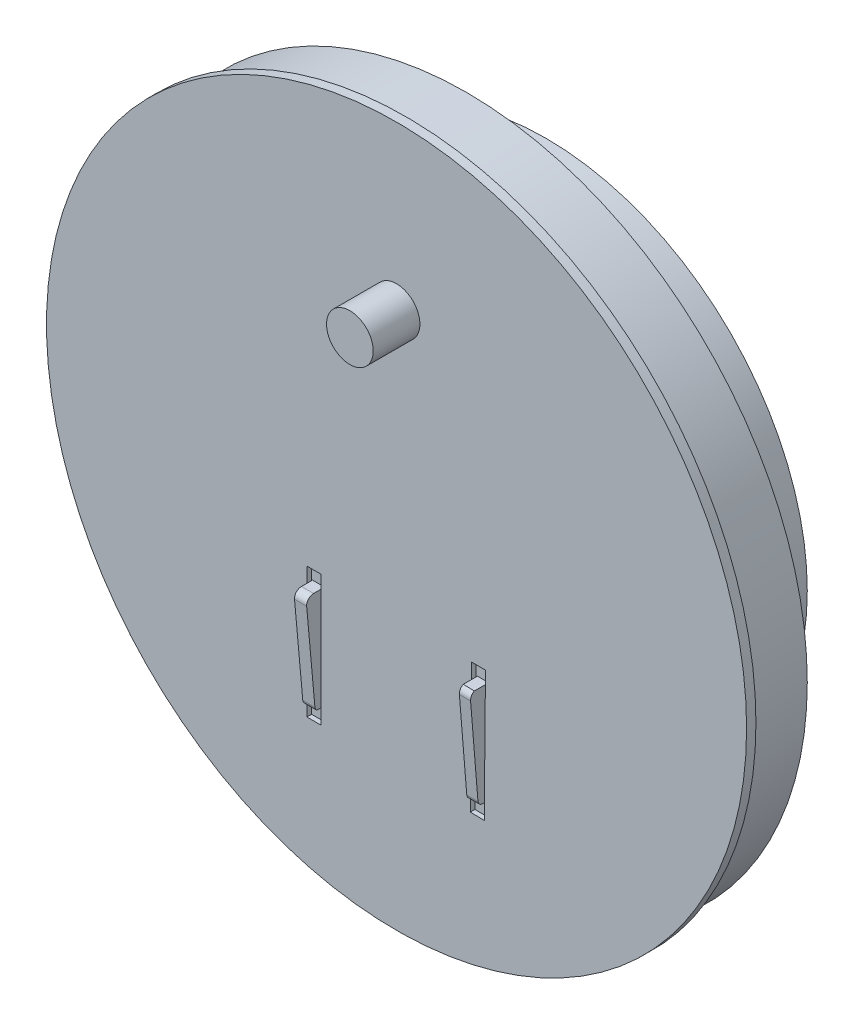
ISO-10303-21;
HEADER;
FILE_DESCRIPTION(('STEP AP214'),'2;1');
FILE_NAME('part.step','',(''),(''),'','','');
FILE_SCHEMA(('AUTOMOTIVE_DESIGN { 1 0 10303 214 1 1 1 1 }'));
ENDSEC;
DATA;
#1=APPLICATION_CONTEXT('core data for automotive mechanical design processes');
#2=APPLICATION_PROTOCOL_DEFINITION('international standard','automotive_design',2000,#1);
#3=PRODUCT_CONTEXT('',#1,'mechanical');
#4=PRODUCT('Part','Part','',(#3));
#5=PRODUCT_RELATED_PRODUCT_CATEGORY('part','',(#4));
#6=PRODUCT_DEFINITION_FORMATION('','',#4);
#7=PRODUCT_DEFINITION_CONTEXT('part definition',#1,'design');
#8=PRODUCT_DEFINITION('design','',#6,#7);
#9=PRODUCT_DEFINITION_SHAPE('','',#8);
#10=(LENGTH_UNIT() NAMED_UNIT(*) SI_UNIT(.MILLI.,.METRE.));
#11=(NAMED_UNIT(*) PLANE_ANGLE_UNIT() SI_UNIT($,.RADIAN.));
#12=(NAMED_UNIT(*) SI_UNIT($,.STERADIAN.) SOLID_ANGLE_UNIT());
#13=UNCERTAINTY_MEASURE_WITH_UNIT(LENGTH_MEASURE(1.E-05),#10,'distance_accuracy_value','');
#14=(GEOMETRIC_REPRESENTATION_CONTEXT(3) GLOBAL_UNCERTAINTY_ASSIGNED_CONTEXT((#13)) GLOBAL_UNIT_ASSIGNED_CONTEXT((#10,
#11,#12)) REPRESENTATION_CONTEXT('',''));
#15=CARTESIAN_POINT('',(0.,0.,0.));
#16=DIRECTION('',(0.,0.,1.));
#17=DIRECTION('',(1.,0.,0.));
#18=AXIS2_PLACEMENT_3D('',#15,#16,#17);
#19=CARTESIAN_POINT('',(16.1168721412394,-42.1527685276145,5.));
#20=DIRECTION('',(0.00936412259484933,0.999956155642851,0.));
#21=DIRECTION('',(-0.999956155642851,0.00936412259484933,0.));
#22=AXIS2_PLACEMENT_3D('',#19,#20,#21);
#23=PLANE('',#22);
#24=DIRECTION('',(0.,0.,-1.));
#25=VECTOR('',#24,1.);
#26=CARTESIAN_POINT('',(18.5167669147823,-42.1752424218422,5.));
#27=LINE('',#26,#25);
#28=CARTESIAN_POINT('',(18.5167669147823,-42.1752424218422,2.0861317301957));
#29=VERTEX_POINT('',#28);
#30=CARTESIAN_POINT('',(18.5167669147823,-42.1752424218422,1.));
#31=VERTEX_POINT('',#30);
#32=EDGE_CURVE('E314',#29,#31,#27,.T.);
#33=ORIENTED_EDGE('',*,*,#32,.F.);
#34=CARTESIAN_POINT('',(-88.269122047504,-41.1752424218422,2.0861317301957));
#35=DIRECTION('',(0.00936412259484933,0.999956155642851,0.));
#36=DIRECTION('',(-0.999956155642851,0.00936412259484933,0.));
#37=AXIS2_PLACEMENT_3D('',#34,#35,#36);
#38=ELLIPSE('',#37,106.790571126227,1.);
#39=CARTESIAN_POINT('',(16.1168721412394,-42.1527685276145,2.29694613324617));
#40=VERTEX_POINT('',#39);
#41=EDGE_CURVE('E276',#29,#40,#38,.F.);
#42=ORIENTED_EDGE('',*,*,#41,.T.);
#43=DIRECTION('',(0.,0.,-1.));
#44=VECTOR('',#43,1.);
#45=CARTESIAN_POINT('',(16.1168721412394,-42.1527685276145,5.));
#46=LINE('',#45,#44);
#47=CARTESIAN_POINT('',(16.1168721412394,-42.1527685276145,1.));
#48=VERTEX_POINT('',#47);
#49=EDGE_CURVE('E317',#40,#48,#46,.T.);
#50=ORIENTED_EDGE('',*,*,#49,.T.);
#51=DIRECTION('',(0.99995615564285,-0.00936412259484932,0.));
#52=VECTOR('',#51,1.);
#53=CARTESIAN_POINT('',(16.1168721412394,-42.1527685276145,1.));
#54=LINE('',#53,#52);
#55=EDGE_CURVE('E296',#48,#31,#54,.T.);
#56=ORIENTED_EDGE('',*,*,#55,.T.);
#57=EDGE_LOOP('',(#33,#42,#50,#56));
#58=FACE_BOUND('',#57,.T.);
#59=ADVANCED_FACE('F41',(#58),#23,.F.);
#60=CARTESIAN_POINT('',(18.722777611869,-20.1762069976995,5.));
#61=DIRECTION('',(-0.00936412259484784,-0.999956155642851,0.));
#62=DIRECTION('',(0.999956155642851,-0.00936412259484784,0.));
#63=AXIS2_PLACEMENT_3D('',#60,#61,#62);
#64=PLANE('',#63);
#65=DIRECTION('',(0.,0.,-1.));
#66=VECTOR('',#65,1.);
#67=CARTESIAN_POINT('',(16.3228828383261,-20.1537331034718,5.));
#68=LINE('',#67,#66);
#69=CARTESIAN_POINT('',(16.3228828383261,-20.1537331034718,4.02011287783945));
#70=VERTEX_POINT('',#69);
#71=CARTESIAN_POINT('',(16.3228828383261,-20.1537331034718,1.));
#72=VERTEX_POINT('',#71);
#73=EDGE_CURVE('E308',#70,#72,#68,.T.);
#74=ORIENTED_EDGE('',*,*,#73,.F.);
#75=CARTESIAN_POINT('',(160.085190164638,-21.5000000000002,3.35862558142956));
#76=DIRECTION('',(-0.00936412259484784,-0.999956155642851,0.));
#77=DIRECTION('',(-0.999956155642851,0.00936412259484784,0.));
#78=AXIS2_PLACEMENT_3D('',#75,#76,#77);
#79=ELLIPSE('',#78,160.185856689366,1.5);
#80=CARTESIAN_POINT('',(18.722777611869,-20.1762069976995,4.06401347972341));
#81=VERTEX_POINT('',#80);
#82=EDGE_CURVE('E574',#70,#81,#79,.F.);
#83=ORIENTED_EDGE('',*,*,#82,.T.);
#84=DIRECTION('',(0.,0.,-1.));
#85=VECTOR('',#84,1.);
#86=CARTESIAN_POINT('',(18.722777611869,-20.1762069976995,5.));
#87=LINE('',#86,#85);
#88=CARTESIAN_POINT('',(18.722777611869,-20.1762069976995,1.));
#89=VERTEX_POINT('',#88);
#90=EDGE_CURVE('E311',#81,#89,#87,.T.);
#91=ORIENTED_EDGE('',*,*,#90,.T.);
#92=DIRECTION('',(-0.99995615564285,0.00936412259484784,0.));
#93=VECTOR('',#92,1.);
#94=CARTESIAN_POINT('',(18.722777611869,-20.1762069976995,1.));
#95=LINE('',#94,#93);
#96=EDGE_CURVE('E304',#89,#72,#95,.T.);
#97=ORIENTED_EDGE('',*,*,#96,.T.);
#98=EDGE_LOOP('',(#74,#83,#91,#97));
#99=FACE_BOUND('',#98,.T.);
#100=ADVANCED_FACE('F604',(#99),#64,.F.);
#101=CARTESIAN_POINT('',(0.,0.,1.));
#102=DIRECTION('',(0.,0.,1.));
#103=DIRECTION('',(1.,0.,0.));
#104=AXIS2_PLACEMENT_3D('',#101,#102,#103);
#105=PLANE('',#104);
#106=DIRECTION('',(0.00936412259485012,0.999956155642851,0.));
#107=VECTOR('',#106,1.);
#108=CARTESIAN_POINT('',(19.2100469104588,-0.179893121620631,1.));
#109=LINE('',#108,#107);
#110=CARTESIAN_POINT('',(18.7886613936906,-45.1779201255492,0.999999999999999));
#111=VERTEX_POINT('',#110);
#112=CARTESIAN_POINT('',(19.0508568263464,-17.1791477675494,0.999999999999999));
#113=VERTEX_POINT('',#112);
#114=EDGE_CURVE('E554',#111,#113,#109,.T.);
#115=ORIENTED_EDGE('',*,*,#114,.T.);
#116=DIRECTION('',(-0.999956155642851,0.00936412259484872,0.));
#117=VECTOR('',#116,1.);
#118=CARTESIAN_POINT('',(-0.159190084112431,-16.9992546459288,1.));
#119=LINE('',#118,#117);
#120=CARTESIAN_POINT('',(16.0509883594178,-17.1510553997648,0.999999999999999));
#121=VERTEX_POINT('',#120);
#122=EDGE_CURVE('E527',#113,#121,#119,.T.);
#123=ORIENTED_EDGE('',*,*,#122,.T.);
#124=DIRECTION('',(-0.00936412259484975,-0.999956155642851,0.));
#125=VECTOR('',#124,1.);
#126=CARTESIAN_POINT('',(16.2101784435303,-0.151800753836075,1.));
#127=LINE('',#126,#125);
#128=CARTESIAN_POINT('',(15.788792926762,-45.1498277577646,0.999999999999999));
#129=VERTEX_POINT('',#128);
#130=EDGE_CURVE('E546',#121,#129,#127,.T.);
#131=ORIENTED_EDGE('',*,*,#130,.T.);
#132=DIRECTION('',(0.999956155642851,-0.00936412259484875,0.));
#133=VECTOR('',#132,1.);
#134=CARTESIAN_POINT('',(-0.421385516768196,-44.9980270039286,1.));
#135=LINE('',#134,#133);
#136=EDGE_CURVE('E550',#129,#111,#135,.T.);
#137=ORIENTED_EDGE('',*,*,#136,.T.);
#138=EDGE_LOOP('',(#115,#123,#131,#137));
#139=FACE_BOUND('',#138,.T.);
#140=ORIENTED_EDGE('',*,*,#55,.F.);
#141=DIRECTION('',(-0.0093641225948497,-0.999956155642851,0.));
#142=VECTOR('',#141,1.);
#143=CARTESIAN_POINT('',(16.3228828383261,-20.1537331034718,1.));
#144=LINE('',#143,#142);
#145=EDGE_CURVE('E292',#72,#48,#144,.T.);
#146=ORIENTED_EDGE('',*,*,#145,.F.);
#147=ORIENTED_EDGE('',*,*,#96,.F.);
#148=DIRECTION('',(0.00936412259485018,0.999956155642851,0.));
#149=VECTOR('',#148,1.);
#150=CARTESIAN_POINT('',(18.5167669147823,-42.1752424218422,1.));
#151=LINE('',#150,#149);
#152=EDGE_CURVE('E300',#31,#89,#151,.T.);
#153=ORIENTED_EDGE('',*,*,#152,.F.);
#154=EDGE_LOOP('',(#140,#146,#147,#153));
#155=FACE_BOUND('',#154,.T.);
#156=ADVANCED_FACE('F601',(#139,#155),#105,.T.);
#157=CARTESIAN_POINT('',(0.,0.,1.));
#158=DIRECTION('',(0.,0.,-1.));
#159=DIRECTION('',(-1.,0.,0.));
#160=AXIS2_PLACEMENT_3D('',#157,#158,#159);
#161=PLANE('',#160);
#162=DIRECTION('',(-1.,0.,0.));
#163=VECTOR('',#162,1.);
#164=CARTESIAN_POINT('',(0.,-17.0000000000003,1.));
#165=LINE('',#164,#163);
#166=CARTESIAN_POINT('',(-16.2108891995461,-17.0000000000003,0.999999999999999));
#167=VERTEX_POINT('',#166);
#168=CARTESIAN_POINT('',(-19.2108891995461,-17.0000000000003,0.999999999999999));
#169=VERTEX_POINT('',#168);
#170=EDGE_CURVE('E566',#167,#169,#165,.T.);
#171=ORIENTED_EDGE('',*,*,#170,.T.);
#172=DIRECTION('',(0.,-1.,0.));
#173=VECTOR('',#172,1.);
#174=CARTESIAN_POINT('',(-19.2108891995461,0.,1.));
#175=LINE('',#174,#173);
#176=CARTESIAN_POINT('',(-19.2108891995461,-45.0000000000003,0.999999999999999));
#177=VERTEX_POINT('',#176);
#178=EDGE_CURVE('E570',#169,#177,#175,.T.);
#179=ORIENTED_EDGE('',*,*,#178,.T.);
#180=DIRECTION('',(1.,0.,0.));
#181=VECTOR('',#180,1.);
#182=CARTESIAN_POINT('',(0.,-45.0000000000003,1.));
#183=LINE('',#182,#181);
#184=CARTESIAN_POINT('',(-16.2108891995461,-45.0000000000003,0.999999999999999));
#185=VERTEX_POINT('',#184);
#186=EDGE_CURVE('E558',#177,#185,#183,.T.);
#187=ORIENTED_EDGE('',*,*,#186,.T.);
#188=DIRECTION('',(0.,1.,0.));
#189=VECTOR('',#188,1.);
#190=CARTESIAN_POINT('',(-16.2108891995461,0.,1.));
#191=LINE('',#190,#189);
#192=EDGE_CURVE('E562',#185,#167,#191,.T.);
#193=ORIENTED_EDGE('',*,*,#192,.T.);
#194=EDGE_LOOP('',(#171,#179,#187,#193));
#195=FACE_BOUND('',#194,.T.);
#196=DIRECTION('',(0.,-1.,0.));
#197=VECTOR('',#196,1.);
#198=CARTESIAN_POINT('',(-19.0108891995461,-20.0000000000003,1.));
#199=LINE('',#198,#197);
#200=CARTESIAN_POINT('',(-19.0108891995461,-20.0000000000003,1.));
#201=VERTEX_POINT('',#200);
#202=CARTESIAN_POINT('',(-19.0108891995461,-42.0000000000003,1.));
#203=VERTEX_POINT('',#202);
#204=EDGE_CURVE('E320',#201,#203,#199,.T.);
#205=ORIENTED_EDGE('',*,*,#204,.F.);
#206=DIRECTION('',(-1.,0.,0.));
#207=VECTOR('',#206,1.);
#208=CARTESIAN_POINT('',(-16.4108891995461,-20.0000000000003,1.));
#209=LINE('',#208,#207);
#210=CARTESIAN_POINT('',(-16.4108891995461,-20.0000000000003,1.));
#211=VERTEX_POINT('',#210);
#212=EDGE_CURVE('E332',#211,#201,#209,.T.);
#213=ORIENTED_EDGE('',*,*,#212,.F.);
#214=DIRECTION('',(0.,1.,0.));
#215=VECTOR('',#214,1.);
#216=CARTESIAN_POINT('',(-16.4108891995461,-42.0000000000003,1.));
#217=LINE('',#216,#215);
#218=CARTESIAN_POINT('',(-16.4108891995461,-42.0000000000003,1.));
#219=VERTEX_POINT('',#218);
#220=EDGE_CURVE('E328',#219,#211,#217,.T.);
#221=ORIENTED_EDGE('',*,*,#220,.F.);
#222=DIRECTION('',(1.,0.,0.));
#223=VECTOR('',#222,1.);
#224=CARTESIAN_POINT('',(-19.0108891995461,-42.0000000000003,1.));
#225=LINE('',#224,#223);
#226=EDGE_CURVE('E324',#203,#219,#225,.T.);
#227=ORIENTED_EDGE('',*,*,#226,.F.);
#228=EDGE_LOOP('',(#205,#213,#221,#227));
#229=FACE_BOUND('',#228,.T.);
#230=ADVANCED_FACE('F611',(#195,#229),#161,.F.);
#231=CARTESIAN_POINT('',(0.,0.,2.));
#232=DIRECTION('',(0.,0.,-1.));
#233=DIRECTION('',(-1.,0.,0.));
#234=AXIS2_PLACEMENT_3D('',#231,#232,#233);
#235=CYLINDRICAL_SURFACE('',#234,75.);
#236=CARTESIAN_POINT('',(0.,0.,2.));
#237=DIRECTION('',(0.,0.,1.));
#238=DIRECTION('',(1.,0.,0.));
#239=AXIS2_PLACEMENT_3D('',#236,#237,#238);
#240=CIRCLE('',#239,75.);
#241=CARTESIAN_POINT('',(75.,0.,2.));
#242=VERTEX_POINT('',#241);
#243=EDGE_CURVE('E536',#242,#242,#240,.T.);
#244=ORIENTED_EDGE('',*,*,#243,.F.);
#245=EDGE_LOOP('',(#244));
#246=FACE_BOUND('',#245,.T.);
#247=CARTESIAN_POINT('',(0.,0.,0.));
#248=DIRECTION('',(0.,0.,1.));
#249=DIRECTION('',(1.,0.,0.));
#250=AXIS2_PLACEMENT_3D('',#247,#248,#249);
#251=CIRCLE('',#250,75.);
#252=CARTESIAN_POINT('',(75.,0.,0.));
#253=VERTEX_POINT('',#252);
#254=EDGE_CURVE('E532',#253,#253,#251,.T.);
#255=ORIENTED_EDGE('',*,*,#254,.T.);
#256=EDGE_LOOP('',(#255));
#257=FACE_BOUND('',#256,.T.);
#258=ADVANCED_FACE('F43',(#246,#257),#235,.T.);
#259=CARTESIAN_POINT('',(0.,0.,2.));
#260=DIRECTION('',(0.,0.,1.));
#261=DIRECTION('',(1.,0.,0.));
#262=AXIS2_PLACEMENT_3D('',#259,#260,#261);
#263=PLANE('',#262);
#264=DIRECTION('',(0.,-1.,0.));
#265=VECTOR('',#264,1.);
#266=CARTESIAN_POINT('',(-19.2108891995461,-45.0000000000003,2.));
#267=LINE('',#266,#265);
#268=CARTESIAN_POINT('',(-19.2108891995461,-17.0000000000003,2.));
#269=VERTEX_POINT('',#268);
#270=CARTESIAN_POINT('',(-19.2108891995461,-45.0000000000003,2.));
#271=VERTEX_POINT('',#270);
#272=EDGE_CURVE('E439',#269,#271,#267,.T.);
#273=ORIENTED_EDGE('',*,*,#272,.F.);
#274=DIRECTION('',(-1.,0.,0.));
#275=VECTOR('',#274,1.);
#276=CARTESIAN_POINT('',(-19.2108891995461,-17.0000000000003,2.));
#277=LINE('',#276,#275);
#278=CARTESIAN_POINT('',(-16.2108891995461,-17.0000000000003,2.));
#279=VERTEX_POINT('',#278);
#280=EDGE_CURVE('E451',#279,#269,#277,.T.);
#281=ORIENTED_EDGE('',*,*,#280,.F.);
#282=DIRECTION('',(0.,1.,0.));
#283=VECTOR('',#282,1.);
#284=CARTESIAN_POINT('',(-16.2108891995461,-45.0000000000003,2.));
#285=LINE('',#284,#283);
#286=CARTESIAN_POINT('',(-16.2108891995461,-45.0000000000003,2.));
#287=VERTEX_POINT('',#286);
#288=EDGE_CURVE('E447',#287,#279,#285,.T.);
#289=ORIENTED_EDGE('',*,*,#288,.F.);
#290=DIRECTION('',(1.,0.,0.));
#291=VECTOR('',#290,1.);
#292=CARTESIAN_POINT('',(-19.2108891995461,-45.0000000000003,2.));
#293=LINE('',#292,#291);
#294=EDGE_CURVE('E442',#271,#287,#293,.T.);
#295=ORIENTED_EDGE('',*,*,#294,.F.);
#296=EDGE_LOOP('',(#273,#281,#289,#295));
#297=FACE_BOUND('',#296,.T.);
#298=DIRECTION('',(0.00936412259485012,0.99995615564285,0.));
#299=VECTOR('',#298,1.);
#300=CARTESIAN_POINT('',(18.7886613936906,-45.1779201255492,2.));
#301=LINE('',#300,#299);
#302=CARTESIAN_POINT('',(18.7886613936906,-45.1779201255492,2.));
#303=VERTEX_POINT('',#302);
#304=CARTESIAN_POINT('',(19.0508568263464,-17.1791477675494,2.));
#305=VERTEX_POINT('',#304);
#306=EDGE_CURVE('E424',#303,#305,#301,.T.);
#307=ORIENTED_EDGE('',*,*,#306,.F.);
#308=DIRECTION('',(0.99995615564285,-0.00936412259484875,0.));
#309=VECTOR('',#308,1.);
#310=CARTESIAN_POINT('',(18.7886613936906,-45.1779201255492,2.));
#311=LINE('',#310,#309);
#312=CARTESIAN_POINT('',(15.788792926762,-45.1498277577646,2.));
#313=VERTEX_POINT('',#312);
#314=EDGE_CURVE('E479',#313,#303,#311,.T.);
#315=ORIENTED_EDGE('',*,*,#314,.F.);
#316=DIRECTION('',(-0.00936412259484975,-0.99995615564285,0.));
#317=VECTOR('',#316,1.);
#318=CARTESIAN_POINT('',(15.788792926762,-45.1498277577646,2.));
#319=LINE('',#318,#317);
#320=CARTESIAN_POINT('',(16.0509883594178,-17.1510553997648,2.));
#321=VERTEX_POINT('',#320);
#322=EDGE_CURVE('E475',#321,#313,#319,.T.);
#323=ORIENTED_EDGE('',*,*,#322,.F.);
#324=DIRECTION('',(-0.999956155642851,0.00936412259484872,0.));
#325=VECTOR('',#324,1.);
#326=CARTESIAN_POINT('',(19.0508568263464,-17.1791477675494,2.));
#327=LINE('',#326,#325);
#328=EDGE_CURVE('E471',#305,#321,#327,.T.);
#329=ORIENTED_EDGE('',*,*,#328,.F.);
#330=EDGE_LOOP('',(#307,#315,#323,#329));
#331=FACE_BOUND('',#330,.T.);
#332=CARTESIAN_POINT('',(0.,40.,2.));
#333=DIRECTION('',(0.,0.,1.));
#334=DIRECTION('',(1.,0.,0.));
#335=AXIS2_PLACEMENT_3D('',#332,#333,#334);
#336=CIRCLE('',#335,5.);
#337=CARTESIAN_POINT('',(5.00000000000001,40.,2.));
#338=VERTEX_POINT('',#337);
#339=EDGE_CURVE('E459',#338,#338,#336,.T.);
#340=ORIENTED_EDGE('',*,*,#339,.F.);
#341=EDGE_LOOP('',(#340));
#342=FACE_BOUND('',#341,.T.);
#343=ORIENTED_EDGE('',*,*,#243,.T.);
#344=EDGE_LOOP('',(#343));
#345=FACE_BOUND('',#344,.T.);
#346=ADVANCED_FACE('F752',(#297,#331,#342,#345),#263,.T.);
#347=CARTESIAN_POINT('',(0.,0.,0.));
#348=DIRECTION('',(0.,0.,1.));
#349=DIRECTION('',(1.,0.,0.));
#350=AXIS2_PLACEMENT_3D('',#347,#348,#349);
#351=PLANE('',#350);
#352=CARTESIAN_POINT('',(0.,0.,0.));
#353=DIRECTION('',(0.,0.,-1.));
#354=DIRECTION('',(-1.,0.,0.));
#355=AXIS2_PLACEMENT_3D('',#352,#353,#354);
#356=CIRCLE('',#355,73.);
#357=CARTESIAN_POINT('',(73.,0.,0.));
#358=VERTEX_POINT('',#357);
#359=EDGE_CURVE('E528',#358,#358,#356,.T.);
#360=ORIENTED_EDGE('',*,*,#359,.F.);
#361=EDGE_LOOP('',(#360));
#362=FACE_BOUND('',#361,.T.);
#363=ORIENTED_EDGE('',*,*,#254,.F.);
#364=EDGE_LOOP('',(#363));
#365=FACE_BOUND('',#364,.T.);
#366=ADVANCED_FACE('F750',(#362,#365),#351,.F.);
#367=CARTESIAN_POINT('',(0.,0.,-13.));
#368=DIRECTION('',(0.,0.,1.));
#369=DIRECTION('',(1.,0.,0.));
#370=AXIS2_PLACEMENT_3D('',#367,#368,#369);
#371=CYLINDRICAL_SURFACE('',#370,73.);
#372=CARTESIAN_POINT('',(0.,0.,-13.));
#373=DIRECTION('',(0.,0.,-1.));
#374=DIRECTION('',(-1.,0.,0.));
#375=AXIS2_PLACEMENT_3D('',#372,#373,#374);
#376=CIRCLE('',#375,73.);
#377=CARTESIAN_POINT('',(73.,0.,-13.));
#378=VERTEX_POINT('',#377);
#379=EDGE_CURVE('E522',#378,#378,#376,.T.);
#380=CARTESIAN_POINT('',(73.,0.,-13.));
#381=CARTESIAN_POINT('',(73.,0.,-12.8645833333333));
#382=CARTESIAN_POINT('',(73.,0.,-12.7291666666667));
#383=CARTESIAN_POINT('',(73.,0.,-12.4583333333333));
#384=CARTESIAN_POINT('',(73.,0.,-12.3229166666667));
#385=CARTESIAN_POINT('',(73.,0.,-12.0520833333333));
#386=CARTESIAN_POINT('',(73.,0.,-11.9166666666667));
#387=CARTESIAN_POINT('',(73.,0.,-11.6458333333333));
#388=CARTESIAN_POINT('',(73.,0.,-11.5104166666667));
#389=CARTESIAN_POINT('',(73.,0.,-11.2395833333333));
#390=CARTESIAN_POINT('',(73.,0.,-11.1041666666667));
#391=CARTESIAN_POINT('',(73.,0.,-10.8333333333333));
#392=CARTESIAN_POINT('',(73.,0.,-10.6979166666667));
#393=CARTESIAN_POINT('',(73.,0.,-10.4270833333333));
#394=CARTESIAN_POINT('',(73.,0.,-10.2916666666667));
#395=CARTESIAN_POINT('',(73.,0.,-10.0208333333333));
#396=CARTESIAN_POINT('',(73.,0.,-9.88541666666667));
#397=CARTESIAN_POINT('',(73.,0.,-9.61458333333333));
#398=CARTESIAN_POINT('',(73.,0.,-9.47916666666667));
#399=CARTESIAN_POINT('',(73.,0.,-9.20833333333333));
#400=CARTESIAN_POINT('',(73.,0.,-9.07291666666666));
#401=CARTESIAN_POINT('',(73.,0.,-8.80208333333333));
#402=CARTESIAN_POINT('',(73.,0.,-8.66666666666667));
#403=CARTESIAN_POINT('',(73.,0.,-8.39583333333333));
#404=CARTESIAN_POINT('',(73.,0.,-8.26041666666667));
#405=CARTESIAN_POINT('',(73.,0.,-7.98958333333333));
#406=CARTESIAN_POINT('',(73.,0.,-7.85416666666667));
#407=CARTESIAN_POINT('',(73.,0.,-7.58333333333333));
#408=CARTESIAN_POINT('',(73.,0.,-7.44791666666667));
#409=CARTESIAN_POINT('',(73.,0.,-7.17708333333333));
#410=CARTESIAN_POINT('',(73.,0.,-7.04166666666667));
#411=CARTESIAN_POINT('',(73.,0.,-6.77083333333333));
#412=CARTESIAN_POINT('',(73.,0.,-6.63541666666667));
#413=CARTESIAN_POINT('',(73.,0.,-6.36458333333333));
#414=CARTESIAN_POINT('',(73.,0.,-6.22916666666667));
#415=CARTESIAN_POINT('',(73.,0.,-5.95833333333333));
#416=CARTESIAN_POINT('',(73.,0.,-5.82291666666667));
#417=CARTESIAN_POINT('',(73.,0.,-5.55208333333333));
#418=CARTESIAN_POINT('',(73.,0.,-5.41666666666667));
#419=CARTESIAN_POINT('',(73.,0.,-5.14583333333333));
#420=CARTESIAN_POINT('',(73.,0.,-5.01041666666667));
#421=CARTESIAN_POINT('',(73.,0.,-4.73958333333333));
#422=CARTESIAN_POINT('',(73.,0.,-4.60416666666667));
#423=CARTESIAN_POINT('',(73.,0.,-4.33333333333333));
#424=CARTESIAN_POINT('',(73.,0.,-4.19791666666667));
#425=CARTESIAN_POINT('',(73.,0.,-3.92708333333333));
#426=CARTESIAN_POINT('',(73.,0.,-3.79166666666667));
#427=CARTESIAN_POINT('',(73.,0.,-3.52083333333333));
#428=CARTESIAN_POINT('',(73.,0.,-3.38541666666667));
#429=CARTESIAN_POINT('',(73.,0.,-3.11458333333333));
#430=CARTESIAN_POINT('',(73.,0.,-2.97916666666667));
#431=CARTESIAN_POINT('',(73.,0.,-2.70833333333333));
#432=CARTESIAN_POINT('',(73.,0.,-2.57291666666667));
#433=CARTESIAN_POINT('',(73.,0.,-2.30208333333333));
#434=CARTESIAN_POINT('',(73.,0.,-2.16666666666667));
#435=CARTESIAN_POINT('',(73.,0.,-1.89583333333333));
#436=CARTESIAN_POINT('',(73.,0.,-1.76041666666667));
#437=CARTESIAN_POINT('',(73.,0.,-1.48958333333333));
#438=CARTESIAN_POINT('',(73.,0.,-1.35416666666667));
#439=CARTESIAN_POINT('',(73.,0.,-1.08333333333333));
#440=CARTESIAN_POINT('',(73.,0.,-0.947916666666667));
#441=CARTESIAN_POINT('',(73.,0.,-0.677083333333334));
#442=CARTESIAN_POINT('',(73.,0.,-0.541666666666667));
#443=CARTESIAN_POINT('',(73.,0.,-0.270833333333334));
#444=CARTESIAN_POINT('',(73.,0.,-0.135416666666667));
#445=CARTESIAN_POINT('',(73.,0.,0.));
#446=B_SPLINE_CURVE_WITH_KNOTS('',3,(#380,#381,#382,#383,#384,#385,#386,#387,#388,#389,#390,
#391,#392,#393,#394,#395,#396,#397,#398,#399,#400,#401,#402,#403,#404,#405,#406,#407,#408,#409,
#410,#411,#412,#413,#414,#415,#416,#417,#418,#419,#420,#421,#422,#423,#424,#425,#426,#427,#428,
#429,#430,#431,#432,#433,#434,#435,#436,#437,#438,#439,#440,#441,#442,#443,#444,#445),
.UNSPECIFIED.,.F.,.F.,(4,2,2,2,2,2,2,2,2,2,2,2,2,2,2,2,2,2,2,2,2,2,2,2,2,2,2,2,2,2,2,2,4),(0.,
0.40625,0.812500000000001,1.21875,1.625,2.03125,2.4375,2.84375,3.25,3.65625,4.0625,4.46875,
4.875,5.28125,5.6875,6.09375,6.5,6.90625,7.3125,7.71875,8.125,8.53125,8.9375,9.34375,9.75,
10.15625,10.5625,10.96875,11.375,11.78125,12.1875,12.59375,13.),.UNSPECIFIED.);
#447=EDGE_CURVE('BSEAM746',#378,#358,#446,.T.);
#448=ORIENTED_EDGE('',*,*,#379,.F.);
#449=ORIENTED_EDGE('',*,*,#359,.T.);
#450=ORIENTED_EDGE('',*,*,#447,.T.);
#451=ORIENTED_EDGE('',*,*,#447,.F.);
#452=EDGE_LOOP('',(#448,#450,#449,#451));
#453=FACE_BOUND('',#452,.T.);
#454=ADVANCED_FACE('F746',(#453),#371,.T.);
#455=CARTESIAN_POINT('',(0.,0.,-13.));
#456=DIRECTION('',(0.,0.,-1.));
#457=DIRECTION('',(-1.,0.,0.));
#458=AXIS2_PLACEMENT_3D('',#455,#456,#457);
#459=PLANE('',#458);
#460=CARTESIAN_POINT('',(0.,0.,-13.));
#461=DIRECTION('',(0.,0.,-1.));
#462=DIRECTION('',(-1.,0.,0.));
#463=AXIS2_PLACEMENT_3D('',#460,#461,#462);
#464=CIRCLE('',#463,56.);
#465=CARTESIAN_POINT('',(-56.,0.,-13.));
#466=VERTEX_POINT('',#465);
#467=EDGE_CURVE('E523',#466,#466,#464,.T.);
#468=ORIENTED_EDGE('',*,*,#467,.F.);
#469=EDGE_LOOP('',(#468));
#470=FACE_BOUND('',#469,.T.);
#471=ORIENTED_EDGE('',*,*,#379,.T.);
#472=EDGE_LOOP('',(#471));
#473=FACE_BOUND('',#472,.T.);
#474=ADVANCED_FACE('F742',(#470,#473),#459,.T.);
#475=CARTESIAN_POINT('',(0.,0.,-30.));
#476=DIRECTION('',(0.,0.,1.));
#477=DIRECTION('',(1.,0.,0.));
#478=AXIS2_PLACEMENT_3D('',#475,#476,#477);
#479=CYLINDRICAL_SURFACE('',#478,56.);
#480=CARTESIAN_POINT('',(0.,0.,-30.));
#481=DIRECTION('',(0.,0.,-1.));
#482=DIRECTION('',(-1.,0.,0.));
#483=AXIS2_PLACEMENT_3D('',#480,#481,#482);
#484=CIRCLE('',#483,56.);
#485=CARTESIAN_POINT('',(-56.,0.,-30.));
#486=VERTEX_POINT('',#485);
#487=EDGE_CURVE('E515',#486,#486,#484,.T.);
#488=ORIENTED_EDGE('',*,*,#487,.F.);
#489=EDGE_LOOP('',(#488));
#490=FACE_BOUND('',#489,.T.);
#491=ORIENTED_EDGE('',*,*,#467,.T.);
#492=EDGE_LOOP('',(#491));
#493=FACE_BOUND('',#492,.T.);
#494=ADVANCED_FACE('F738',(#490,#493),#479,.T.);
#495=CARTESIAN_POINT('',(0.,0.,-30.));
#496=DIRECTION('',(0.,0.,-1.));
#497=DIRECTION('',(-1.,0.,0.));
#498=AXIS2_PLACEMENT_3D('',#495,#496,#497);
#499=PLANE('',#498);
#500=CARTESIAN_POINT('',(0.,0.,-30.));
#501=DIRECTION('',(0.,0.,-1.));
#502=DIRECTION('',(-1.,0.,0.));
#503=AXIS2_PLACEMENT_3D('',#500,#501,#502);
#504=CIRCLE('',#503,55.);
#505=CARTESIAN_POINT('',(-55.,0.,-30.));
#506=VERTEX_POINT('',#505);
#507=EDGE_CURVE('E499',#506,#506,#504,.T.);
#508=ORIENTED_EDGE('',*,*,#507,.F.);
#509=EDGE_LOOP('',(#508));
#510=FACE_BOUND('',#509,.T.);
#511=ORIENTED_EDGE('',*,*,#487,.T.);
#512=EDGE_LOOP('',(#511));
#513=FACE_BOUND('',#512,.T.);
#514=ADVANCED_FACE('F724',(#510,#513),#499,.T.);
#515=CARTESIAN_POINT('',(0.,0.,1.));
#516=DIRECTION('',(0.,0.,1.));
#517=DIRECTION('',(1.,0.,0.));
#518=AXIS2_PLACEMENT_3D('',#515,#516,#517);
#519=PLANE('',#518);
#520=DIRECTION('',(0.,-1.,0.));
#521=VECTOR('',#520,1.);
#522=CARTESIAN_POINT('',(-22.2108891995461,0.,1.));
#523=LINE('',#522,#521);
#524=CARTESIAN_POINT('',(-22.2108891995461,-14.0000000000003,1.));
#525=VERTEX_POINT('',#524);
#526=CARTESIAN_POINT('',(-22.2108891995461,-48.0000000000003,1.));
#527=VERTEX_POINT('',#526);
#528=EDGE_CURVE('E370',#525,#527,#523,.T.);
#529=ORIENTED_EDGE('',*,*,#528,.T.);
#530=DIRECTION('',(1.,0.,0.));
#531=VECTOR('',#530,1.);
#532=CARTESIAN_POINT('',(0.,-48.0000000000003,1.));
#533=LINE('',#532,#531);
#534=CARTESIAN_POINT('',(-13.2108891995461,-48.0000000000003,1.));
#535=VERTEX_POINT('',#534);
#536=EDGE_CURVE('E348',#527,#535,#533,.T.);
#537=ORIENTED_EDGE('',*,*,#536,.T.);
#538=DIRECTION('',(0.,1.,0.));
#539=VECTOR('',#538,1.);
#540=CARTESIAN_POINT('',(-13.2108891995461,0.,1.));
#541=LINE('',#540,#539);
#542=CARTESIAN_POINT('',(-13.2108891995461,-14.0000000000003,1.));
#543=VERTEX_POINT('',#542);
#544=EDGE_CURVE('E354',#535,#543,#541,.T.);
#545=ORIENTED_EDGE('',*,*,#544,.T.);
#546=DIRECTION('',(-1.,0.,0.));
#547=VECTOR('',#546,1.);
#548=CARTESIAN_POINT('',(0.,-14.0000000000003,1.));
#549=LINE('',#548,#547);
#550=EDGE_CURVE('E374',#543,#525,#549,.T.);
#551=ORIENTED_EDGE('',*,*,#550,.T.);
#552=EDGE_LOOP('',(#529,#537,#545,#551));
#553=FACE_BOUND('',#552,.T.);
#554=DIRECTION('',(-0.00936412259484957,-0.99995615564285,0.));
#555=VECTOR('',#554,1.);
#556=CARTESIAN_POINT('',(13.0792122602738,-14.1230945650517,1.));
#557=LINE('',#556,#555);
#558=CARTESIAN_POINT('',(13.0792122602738,-14.1230945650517,1.));
#559=VERTEX_POINT('',#558);
#560=CARTESIAN_POINT('',(12.7608320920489,-48.1216038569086,1.));
#561=VERTEX_POINT('',#560);
#562=EDGE_CURVE('E407',#559,#561,#557,.T.);
#563=ORIENTED_EDGE('',*,*,#562,.T.);
#564=DIRECTION('',(0.99995615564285,-0.00936412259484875,0.));
#565=VECTOR('',#564,1.);
#566=CARTESIAN_POINT('',(12.7608320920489,-48.1216038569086,1.));
#567=LINE('',#566,#565);
#568=CARTESIAN_POINT('',(21.7604374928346,-48.2058809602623,1.));
#569=VERTEX_POINT('',#568);
#570=EDGE_CURVE('E420',#561,#569,#567,.T.);
#571=ORIENTED_EDGE('',*,*,#570,.T.);
#572=DIRECTION('',(0.00936412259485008,0.99995615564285,0.));
#573=VECTOR('',#572,1.);
#574=CARTESIAN_POINT('',(21.7604374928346,-48.2058809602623,1.));
#575=LINE('',#574,#573);
#576=CARTESIAN_POINT('',(22.0788176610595,-14.2073716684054,1.));
#577=VERTEX_POINT('',#576);
#578=EDGE_CURVE('E416',#569,#577,#575,.T.);
#579=ORIENTED_EDGE('',*,*,#578,.T.);
#580=DIRECTION('',(-0.999956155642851,0.00936412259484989,0.));
#581=VECTOR('',#580,1.);
#582=CARTESIAN_POINT('',(22.0788176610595,-14.2073716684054,1.));
#583=LINE('',#582,#581);
#584=EDGE_CURVE('E411',#577,#559,#583,.T.);
#585=ORIENTED_EDGE('',*,*,#584,.T.);
#586=EDGE_LOOP('',(#563,#571,#579,#585));
#587=FACE_BOUND('',#586,.T.);
#588=CARTESIAN_POINT('',(0.,0.,0.999999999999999));
#589=DIRECTION('',(0.,0.,1.));
#590=DIRECTION('',(1.,0.,0.));
#591=AXIS2_PLACEMENT_3D('',#588,#589,#590);
#592=CIRCLE('',#591,72.);
#593=CARTESIAN_POINT('',(72.,0.,0.999999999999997));
#594=VERTEX_POINT('',#593);
#595=EDGE_CURVE('E503',#594,#594,#592,.F.);
#596=ORIENTED_EDGE('',*,*,#595,.T.);
#597=EDGE_LOOP('',(#596));
#598=FACE_BOUND('',#597,.T.);
#599=ADVANCED_FACE('F720',(#553,#587,#598),#519,.F.);
#600=CARTESIAN_POINT('',(0.,0.,-13.));
#601=DIRECTION('',(0.,0.,1.));
#602=DIRECTION('',(1.,0.,0.));
#603=AXIS2_PLACEMENT_3D('',#600,#601,#602);
#604=CYLINDRICAL_SURFACE('',#603,72.);
#605=CARTESIAN_POINT('',(0.,0.,-12.));
#606=DIRECTION('',(0.,0.,-1.));
#607=DIRECTION('',(-1.,0.,0.));
#608=AXIS2_PLACEMENT_3D('',#605,#606,#607);
#609=CIRCLE('',#608,72.);
#610=CARTESIAN_POINT('',(72.,0.,-12.));
#611=VERTEX_POINT('',#610);
#612=EDGE_CURVE('E508',#611,#611,#609,.T.);
#613=CARTESIAN_POINT('',(72.,0.,-12.));
#614=CARTESIAN_POINT('',(72.,0.,-11.8645833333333));
#615=CARTESIAN_POINT('',(72.,0.,-11.7291666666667));
#616=CARTESIAN_POINT('',(72.,0.,-11.4583333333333));
#617=CARTESIAN_POINT('',(72.,0.,-11.3229166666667));
#618=CARTESIAN_POINT('',(72.,0.,-11.0520833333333));
#619=CARTESIAN_POINT('',(72.,0.,-10.9166666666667));
#620=CARTESIAN_POINT('',(72.,0.,-10.6458333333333));
#621=CARTESIAN_POINT('',(72.,0.,-10.5104166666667));
#622=CARTESIAN_POINT('',(72.,0.,-10.2395833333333));
#623=CARTESIAN_POINT('',(72.,0.,-10.1041666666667));
#624=CARTESIAN_POINT('',(72.,0.,-9.83333333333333));
#625=CARTESIAN_POINT('',(72.,0.,-9.69791666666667));
#626=CARTESIAN_POINT('',(72.,0.,-9.42708333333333));
#627=CARTESIAN_POINT('',(72.,0.,-9.29166666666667));
#628=CARTESIAN_POINT('',(72.,0.,-9.02083333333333));
#629=CARTESIAN_POINT('',(72.,0.,-8.88541666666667));
#630=CARTESIAN_POINT('',(72.,0.,-8.61458333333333));
#631=CARTESIAN_POINT('',(72.,0.,-8.47916666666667));
#632=CARTESIAN_POINT('',(72.,0.,-8.20833333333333));
#633=CARTESIAN_POINT('',(72.,0.,-8.07291666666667));
#634=CARTESIAN_POINT('',(72.,0.,-7.80208333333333));
#635=CARTESIAN_POINT('',(72.,0.,-7.66666666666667));
#636=CARTESIAN_POINT('',(72.,0.,-7.39583333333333));
#637=CARTESIAN_POINT('',(72.,0.,-7.26041666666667));
#638=CARTESIAN_POINT('',(72.,0.,-6.98958333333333));
#639=CARTESIAN_POINT('',(72.,0.,-6.85416666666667));
#640=CARTESIAN_POINT('',(72.,0.,-6.58333333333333));
#641=CARTESIAN_POINT('',(72.,0.,-6.44791666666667));
#642=CARTESIAN_POINT('',(72.,0.,-6.17708333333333));
#643=CARTESIAN_POINT('',(72.,0.,-6.04166666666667));
#644=CARTESIAN_POINT('',(72.,0.,-5.77083333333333));
#645=CARTESIAN_POINT('',(72.,0.,-5.63541666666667));
#646=CARTESIAN_POINT('',(72.,0.,-5.36458333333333));
#647=CARTESIAN_POINT('',(72.,0.,-5.22916666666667));
#648=CARTESIAN_POINT('',(72.,0.,-4.95833333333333));
#649=CARTESIAN_POINT('',(72.,0.,-4.82291666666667));
#650=CARTESIAN_POINT('',(72.,0.,-4.55208333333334));
#651=CARTESIAN_POINT('',(72.,0.,-4.41666666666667));
#652=CARTESIAN_POINT('',(72.,0.,-4.14583333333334));
#653=CARTESIAN_POINT('',(72.,0.,-4.01041666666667));
#654=CARTESIAN_POINT('',(72.,0.,-3.73958333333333));
#655=CARTESIAN_POINT('',(72.,0.,-3.60416666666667));
#656=CARTESIAN_POINT('',(72.,0.,-3.33333333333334));
#657=CARTESIAN_POINT('',(72.,0.,-3.19791666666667));
#658=CARTESIAN_POINT('',(72.,0.,-2.92708333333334));
#659=CARTESIAN_POINT('',(72.,0.,-2.79166666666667));
#660=CARTESIAN_POINT('',(72.,0.,-2.52083333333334));
#661=CARTESIAN_POINT('',(72.,0.,-2.38541666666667));
#662=CARTESIAN_POINT('',(72.,0.,-2.11458333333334));
#663=CARTESIAN_POINT('',(72.,0.,-1.97916666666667));
#664=CARTESIAN_POINT('',(72.,0.,-1.70833333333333));
#665=CARTESIAN_POINT('',(72.,0.,-1.57291666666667));
#666=CARTESIAN_POINT('',(72.,0.,-1.30208333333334));
#667=CARTESIAN_POINT('',(72.,0.,-1.16666666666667));
#668=CARTESIAN_POINT('',(72.,0.,-0.895833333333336));
#669=CARTESIAN_POINT('',(72.,0.,-0.760416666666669));
#670=CARTESIAN_POINT('',(72.,0.,-0.489583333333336));
#671=CARTESIAN_POINT('',(72.,0.,-0.354166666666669));
#672=CARTESIAN_POINT('',(72.,0.,-0.0833333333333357));
#673=CARTESIAN_POINT('',(72.,0.,0.0520833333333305));
#674=CARTESIAN_POINT('',(72.,0.,0.322916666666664));
#675=CARTESIAN_POINT('',(72.,0.,0.45833333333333));
#676=CARTESIAN_POINT('',(72.,0.,0.729166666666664));
#677=CARTESIAN_POINT('',(72.,0.,0.864583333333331));
#678=CARTESIAN_POINT('',(72.,0.,0.999999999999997));
#679=B_SPLINE_CURVE_WITH_KNOTS('',3,(#613,#614,#615,#616,#617,#618,#619,#620,#621,#622,#623,
#624,#625,#626,#627,#628,#629,#630,#631,#632,#633,#634,#635,#636,#637,#638,#639,#640,#641,#642,
#643,#644,#645,#646,#647,#648,#649,#650,#651,#652,#653,#654,#655,#656,#657,#658,#659,#660,#661,
#662,#663,#664,#665,#666,#667,#668,#669,#670,#671,#672,#673,#674,#675,#676,#677,#678),
.UNSPECIFIED.,.F.,.F.,(4,2,2,2,2,2,2,2,2,2,2,2,2,2,2,2,2,2,2,2,2,2,2,2,2,2,2,2,2,2,2,2,4),(0.,
0.406249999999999,0.812499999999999,1.21875,1.625,2.03125,2.4375,2.84375,3.25,3.65625,4.0625,
4.46875,4.875,5.28125,5.6875,6.09375,6.5,6.90625,7.3125,7.71875,8.125,8.53125,8.9375,9.34375,
9.75,10.15625,10.5625,10.96875,11.375,11.78125,12.1875,12.59375,13.),.UNSPECIFIED.);
#680=EDGE_CURVE('BSEAM723',#611,#594,#679,.T.);
#681=ORIENTED_EDGE('',*,*,#612,.T.);
#682=ORIENTED_EDGE('',*,*,#595,.F.);
#683=ORIENTED_EDGE('',*,*,#680,.T.);
#684=ORIENTED_EDGE('',*,*,#680,.F.);
#685=EDGE_LOOP('',(#681,#683,#682,#684));
#686=FACE_BOUND('',#685,.T.);
#687=ADVANCED_FACE('F723',(#686),#604,.F.);
#688=CARTESIAN_POINT('',(0.,0.,-12.));
#689=DIRECTION('',(0.,0.,-1.));
#690=DIRECTION('',(-1.,0.,0.));
#691=AXIS2_PLACEMENT_3D('',#688,#689,#690);
#692=PLANE('',#691);
#693=CARTESIAN_POINT('',(0.,0.,-12.));
#694=DIRECTION('',(0.,0.,-1.));
#695=DIRECTION('',(-1.,0.,0.));
#696=AXIS2_PLACEMENT_3D('',#693,#694,#695);
#697=CIRCLE('',#696,55.);
#698=CARTESIAN_POINT('',(-55.,0.,-12.));
#699=VERTEX_POINT('',#698);
#700=EDGE_CURVE('E507',#699,#699,#697,.T.);
#701=ORIENTED_EDGE('',*,*,#700,.T.);
#702=EDGE_LOOP('',(#701));
#703=FACE_BOUND('',#702,.T.);
#704=ORIENTED_EDGE('',*,*,#612,.F.);
#705=EDGE_LOOP('',(#704));
#706=FACE_BOUND('',#705,.T.);
#707=ADVANCED_FACE('F728',(#703,#706),#692,.F.);
#708=CARTESIAN_POINT('',(0.,0.,-30.));
#709=DIRECTION('',(0.,0.,1.));
#710=DIRECTION('',(1.,0.,0.));
#711=AXIS2_PLACEMENT_3D('',#708,#709,#710);
#712=CYLINDRICAL_SURFACE('',#711,55.);
#713=ORIENTED_EDGE('',*,*,#507,.T.);
#714=EDGE_LOOP('',(#713));
#715=FACE_BOUND('',#714,.T.);
#716=ORIENTED_EDGE('',*,*,#700,.F.);
#717=EDGE_LOOP('',(#716));
#718=FACE_BOUND('',#717,.T.);
#719=ADVANCED_FACE('F718',(#715,#718),#712,.F.);
#720=CARTESIAN_POINT('',(0.,40.,12.));
#721=DIRECTION('',(0.,0.,-1.));
#722=DIRECTION('',(-1.,0.,0.));
#723=AXIS2_PLACEMENT_3D('',#720,#721,#722);
#724=CYLINDRICAL_SURFACE('',#723,5.);
#725=CARTESIAN_POINT('',(0.,40.,12.));
#726=DIRECTION('',(0.,0.,1.));
#727=DIRECTION('',(1.,0.,0.));
#728=AXIS2_PLACEMENT_3D('',#725,#726,#727);
#729=CIRCLE('',#728,5.);
#730=CARTESIAN_POINT('',(5.00000000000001,40.,12.));
#731=VERTEX_POINT('',#730);
#732=EDGE_CURVE('E495',#731,#731,#729,.T.);
#733=ORIENTED_EDGE('',*,*,#732,.F.);
#734=EDGE_LOOP('',(#733));
#735=FACE_BOUND('',#734,.T.);
#736=ORIENTED_EDGE('',*,*,#339,.T.);
#737=EDGE_LOOP('',(#736));
#738=FACE_BOUND('',#737,.T.);
#739=ADVANCED_FACE('F714',(#735,#738),#724,.T.);
#740=CARTESIAN_POINT('',(0.,40.,12.));
#741=DIRECTION('',(0.,0.,1.));
#742=DIRECTION('',(1.,0.,0.));
#743=AXIS2_PLACEMENT_3D('',#740,#741,#742);
#744=PLANE('',#743);
#745=ORIENTED_EDGE('',*,*,#732,.T.);
#746=EDGE_LOOP('',(#745));
#747=FACE_BOUND('',#746,.T.);
#748=ADVANCED_FACE('F710',(#747),#744,.T.);
#749=CARTESIAN_POINT('',(18.7886613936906,-45.1779201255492,-13.));
#750=DIRECTION('',(0.999956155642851,-0.00936412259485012,0.));
#751=DIRECTION('',(0.00936412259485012,0.999956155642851,0.));
#752=AXIS2_PLACEMENT_3D('',#749,#750,#751);
#753=PLANE('',#752);
#754=DIRECTION('',(0.,0.,1.));
#755=VECTOR('',#754,1.);
#756=CARTESIAN_POINT('',(18.7886613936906,-45.1779201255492,-13.));
#757=LINE('',#756,#755);
#758=EDGE_CURVE('E443',#111,#303,#757,.T.);
#759=ORIENTED_EDGE('',*,*,#758,.T.);
#760=ORIENTED_EDGE('',*,*,#306,.T.);
#761=DIRECTION('',(0.,0.,1.));
#762=VECTOR('',#761,1.);
#763=CARTESIAN_POINT('',(19.0508568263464,-17.1791477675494,-13.));
#764=LINE('',#763,#762);
#765=EDGE_CURVE('E483',#113,#305,#764,.T.);
#766=ORIENTED_EDGE('',*,*,#765,.F.);
#767=ORIENTED_EDGE('',*,*,#114,.F.);
#768=EDGE_LOOP('',(#759,#760,#766,#767));
#769=FACE_BOUND('',#768,.T.);
#770=ADVANCED_FACE('F700',(#769),#753,.F.);
#771=CARTESIAN_POINT('',(18.7886613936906,-45.1779201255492,-13.));
#772=DIRECTION('',(-0.00936412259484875,-0.999956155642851,0.));
#773=DIRECTION('',(0.999956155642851,-0.00936412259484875,0.));
#774=AXIS2_PLACEMENT_3D('',#771,#772,#773);
#775=PLANE('',#774);
#776=DIRECTION('',(0.,0.,1.));
#777=VECTOR('',#776,1.);
#778=CARTESIAN_POINT('',(15.788792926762,-45.1498277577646,-13.));
#779=LINE('',#778,#777);
#780=EDGE_CURVE('E486',#129,#313,#779,.T.);
#781=ORIENTED_EDGE('',*,*,#780,.T.);
#782=ORIENTED_EDGE('',*,*,#314,.T.);
#783=ORIENTED_EDGE('',*,*,#758,.F.);
#784=ORIENTED_EDGE('',*,*,#136,.F.);
#785=EDGE_LOOP('',(#781,#782,#783,#784));
#786=FACE_BOUND('',#785,.T.);
#787=ADVANCED_FACE('F696',(#786),#775,.F.);
#788=CARTESIAN_POINT('',(15.788792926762,-45.1498277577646,-13.));
#789=DIRECTION('',(-0.999956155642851,0.00936412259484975,0.));
#790=DIRECTION('',(-0.00936412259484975,-0.999956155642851,0.));
#791=AXIS2_PLACEMENT_3D('',#788,#789,#790);
#792=PLANE('',#791);
#793=DIRECTION('',(0.,0.,1.));
#794=VECTOR('',#793,1.);
#795=CARTESIAN_POINT('',(16.0509883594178,-17.1510553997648,-13.));
#796=LINE('',#795,#794);
#797=EDGE_CURVE('E489',#121,#321,#796,.T.);
#798=ORIENTED_EDGE('',*,*,#797,.T.);
#799=ORIENTED_EDGE('',*,*,#322,.T.);
#800=ORIENTED_EDGE('',*,*,#780,.F.);
#801=ORIENTED_EDGE('',*,*,#130,.F.);
#802=EDGE_LOOP('',(#798,#799,#800,#801));
#803=FACE_BOUND('',#802,.T.);
#804=ADVANCED_FACE('F699',(#803),#792,.F.);
#805=CARTESIAN_POINT('',(19.0508568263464,-17.1791477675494,-13.));
#806=DIRECTION('',(0.00936412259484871,0.99995615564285,0.));
#807=DIRECTION('',(-0.999956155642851,0.00936412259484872,0.));
#808=AXIS2_PLACEMENT_3D('',#805,#806,#807);
#809=PLANE('',#808);
#810=ORIENTED_EDGE('',*,*,#765,.T.);
#811=ORIENTED_EDGE('',*,*,#328,.T.);
#812=ORIENTED_EDGE('',*,*,#797,.F.);
#813=ORIENTED_EDGE('',*,*,#122,.F.);
#814=EDGE_LOOP('',(#810,#811,#812,#813));
#815=FACE_BOUND('',#814,.T.);
#816=ADVANCED_FACE('F694',(#815),#809,.F.);
#817=CARTESIAN_POINT('',(-19.2108891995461,-45.0000000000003,-13.));
#818=DIRECTION('',(-1.,0.,0.));
#819=DIRECTION('',(0.,-1.,0.));
#820=AXIS2_PLACEMENT_3D('',#817,#818,#819);
#821=PLANE('',#820);
#822=DIRECTION('',(0.,0.,1.));
#823=VECTOR('',#822,1.);
#824=CARTESIAN_POINT('',(-19.2108891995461,-17.0000000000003,-13.));
#825=LINE('',#824,#823);
#826=EDGE_CURVE('E456',#169,#269,#825,.T.);
#827=ORIENTED_EDGE('',*,*,#826,.T.);
#828=ORIENTED_EDGE('',*,*,#272,.T.);
#829=DIRECTION('',(0.,0.,1.));
#830=VECTOR('',#829,1.);
#831=CARTESIAN_POINT('',(-19.2108891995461,-45.0000000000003,-13.));
#832=LINE('',#831,#830);
#833=EDGE_CURVE('E455',#177,#271,#832,.T.);
#834=ORIENTED_EDGE('',*,*,#833,.F.);
#835=ORIENTED_EDGE('',*,*,#178,.F.);
#836=EDGE_LOOP('',(#827,#828,#834,#835));
#837=FACE_BOUND('',#836,.T.);
#838=ADVANCED_FACE('F684',(#837),#821,.F.);
#839=CARTESIAN_POINT('',(-19.2108891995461,-17.0000000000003,-13.));
#840=DIRECTION('',(0.,1.,0.));
#841=DIRECTION('',(0.,0.,1.));
#842=AXIS2_PLACEMENT_3D('',#839,#840,#841);
#843=PLANE('',#842);
#844=DIRECTION('',(0.,0.,1.));
#845=VECTOR('',#844,1.);
#846=CARTESIAN_POINT('',(-16.2108891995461,-17.0000000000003,-13.));
#847=LINE('',#846,#845);
#848=EDGE_CURVE('E460',#167,#279,#847,.T.);
#849=ORIENTED_EDGE('',*,*,#848,.T.);
#850=ORIENTED_EDGE('',*,*,#280,.T.);
#851=ORIENTED_EDGE('',*,*,#826,.F.);
#852=ORIENTED_EDGE('',*,*,#170,.F.);
#853=EDGE_LOOP('',(#849,#850,#851,#852));
#854=FACE_BOUND('',#853,.T.);
#855=ADVANCED_FACE('F680',(#854),#843,.F.);
#856=CARTESIAN_POINT('',(-16.2108891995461,-45.0000000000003,-13.));
#857=DIRECTION('',(1.,0.,0.));
#858=DIRECTION('',(0.,0.,-1.));
#859=AXIS2_PLACEMENT_3D('',#856,#857,#858);
#860=PLANE('',#859);
#861=DIRECTION('',(0.,0.,1.));
#862=VECTOR('',#861,1.);
#863=CARTESIAN_POINT('',(-16.2108891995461,-45.0000000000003,-13.));
#864=LINE('',#863,#862);
#865=EDGE_CURVE('E463',#185,#287,#864,.T.);
#866=ORIENTED_EDGE('',*,*,#865,.T.);
#867=ORIENTED_EDGE('',*,*,#288,.T.);
#868=ORIENTED_EDGE('',*,*,#848,.F.);
#869=ORIENTED_EDGE('',*,*,#192,.F.);
#870=EDGE_LOOP('',(#866,#867,#868,#869));
#871=FACE_BOUND('',#870,.T.);
#872=ADVANCED_FACE('F683',(#871),#860,.F.);
#873=CARTESIAN_POINT('',(-19.2108891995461,-45.0000000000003,-13.));
#874=DIRECTION('',(0.,-1.,0.));
#875=DIRECTION('',(0.,0.,-1.));
#876=AXIS2_PLACEMENT_3D('',#873,#874,#875);
#877=PLANE('',#876);
#878=ORIENTED_EDGE('',*,*,#833,.T.);
#879=ORIENTED_EDGE('',*,*,#294,.T.);
#880=ORIENTED_EDGE('',*,*,#865,.F.);
#881=ORIENTED_EDGE('',*,*,#186,.F.);
#882=EDGE_LOOP('',(#878,#879,#880,#881));
#883=FACE_BOUND('',#882,.T.);
#884=ADVANCED_FACE('F664',(#883),#877,.F.);
#885=CARTESIAN_POINT('',(12.7608320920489,-48.1216038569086,-9.));
#886=DIRECTION('',(-0.00936412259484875,-0.99995615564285,0.));
#887=DIRECTION('',(0.999956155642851,-0.00936412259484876,0.));
#888=AXIS2_PLACEMENT_3D('',#885,#886,#887);
#889=PLANE('',#888);
#890=ORIENTED_EDGE('',*,*,#570,.F.);
#891=DIRECTION('',(0.,0.,1.));
#892=VECTOR('',#891,1.);
#893=CARTESIAN_POINT('',(12.7608320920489,-48.1216038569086,-9.));
#894=LINE('',#893,#892);
#895=CARTESIAN_POINT('',(12.7608320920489,-48.1216038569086,-9.));
#896=VERTEX_POINT('',#895);
#897=EDGE_CURVE('E393',#896,#561,#894,.T.);
#898=ORIENTED_EDGE('',*,*,#897,.F.);
#899=DIRECTION('',(0.99995615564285,-0.00936412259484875,0.));
#900=VECTOR('',#899,1.);
#901=CARTESIAN_POINT('',(12.7608320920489,-48.1216038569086,-9.));
#902=LINE('',#901,#900);
#903=CARTESIAN_POINT('',(21.7604374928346,-48.2058809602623,-9.));
#904=VERTEX_POINT('',#903);
#905=EDGE_CURVE('E412',#896,#904,#902,.T.);
#906=ORIENTED_EDGE('',*,*,#905,.T.);
#907=DIRECTION('',(0.,0.,1.));
#908=VECTOR('',#907,1.);
#909=CARTESIAN_POINT('',(21.7604374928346,-48.2058809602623,-9.));
#910=LINE('',#909,#908);
#911=EDGE_CURVE('E394',#904,#569,#910,.T.);
#912=ORIENTED_EDGE('',*,*,#911,.T.);
#913=EDGE_LOOP('',(#890,#898,#906,#912));
#914=FACE_BOUND('',#913,.T.);
#915=ADVANCED_FACE('F660',(#914),#889,.T.);
#916=CARTESIAN_POINT('',(13.0792122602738,-14.1230945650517,-9.));
#917=DIRECTION('',(-0.999956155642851,0.00936412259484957,0.));
#918=DIRECTION('',(-0.00936412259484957,-0.999956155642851,0.));
#919=AXIS2_PLACEMENT_3D('',#916,#917,#918);
#920=PLANE('',#919);
#921=ORIENTED_EDGE('',*,*,#562,.F.);
#922=DIRECTION('',(0.,0.,1.));
#923=VECTOR('',#922,1.);
#924=CARTESIAN_POINT('',(13.0792122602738,-14.1230945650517,-9.));
#925=LINE('',#924,#923);
#926=CARTESIAN_POINT('',(13.0792122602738,-14.1230945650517,-9.));
#927=VERTEX_POINT('',#926);
#928=EDGE_CURVE('E402',#927,#559,#925,.T.);
#929=ORIENTED_EDGE('',*,*,#928,.F.);
#930=DIRECTION('',(-0.00936412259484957,-0.99995615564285,0.));
#931=VECTOR('',#930,1.);
#932=CARTESIAN_POINT('',(13.0792122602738,-14.1230945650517,-9.));
#933=LINE('',#932,#931);
#934=EDGE_CURVE('E397',#927,#896,#933,.T.);
#935=ORIENTED_EDGE('',*,*,#934,.T.);
#936=ORIENTED_EDGE('',*,*,#897,.T.);
#937=EDGE_LOOP('',(#921,#929,#935,#936));
#938=FACE_BOUND('',#937,.T.);
#939=ADVANCED_FACE('F663',(#938),#920,.T.);
#940=CARTESIAN_POINT('',(22.0788176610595,-14.2073716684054,-9.));
#941=DIRECTION('',(0.00936412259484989,0.999956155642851,0.));
#942=DIRECTION('',(-0.99995615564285,0.00936412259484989,0.));
#943=AXIS2_PLACEMENT_3D('',#940,#941,#942);
#944=PLANE('',#943);
#945=ORIENTED_EDGE('',*,*,#584,.F.);
#946=DIRECTION('',(0.,0.,1.));
#947=VECTOR('',#946,1.);
#948=CARTESIAN_POINT('',(22.0788176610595,-14.2073716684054,-9.));
#949=LINE('',#948,#947);
#950=CARTESIAN_POINT('',(22.0788176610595,-14.2073716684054,-9.));
#951=VERTEX_POINT('',#950);
#952=EDGE_CURVE('E398',#951,#577,#949,.T.);
#953=ORIENTED_EDGE('',*,*,#952,.F.);
#954=DIRECTION('',(-0.999956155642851,0.00936412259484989,0.));
#955=VECTOR('',#954,1.);
#956=CARTESIAN_POINT('',(22.0788176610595,-14.2073716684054,-9.));
#957=LINE('',#956,#955);
#958=EDGE_CURVE('E428',#951,#927,#957,.T.);
#959=ORIENTED_EDGE('',*,*,#958,.T.);
#960=ORIENTED_EDGE('',*,*,#928,.T.);
#961=EDGE_LOOP('',(#945,#953,#959,#960));
#962=FACE_BOUND('',#961,.T.);
#963=ADVANCED_FACE('F669',(#962),#944,.T.);
#964=CARTESIAN_POINT('',(21.7604374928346,-48.2058809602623,-9.));
#965=DIRECTION('',(0.99995615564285,-0.00936412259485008,0.));
#966=DIRECTION('',(0.00936412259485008,0.999956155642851,0.));
#967=AXIS2_PLACEMENT_3D('',#964,#965,#966);
#968=PLANE('',#967);
#969=ORIENTED_EDGE('',*,*,#578,.F.);
#970=ORIENTED_EDGE('',*,*,#911,.F.);
#971=DIRECTION('',(0.00936412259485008,0.99995615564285,0.));
#972=VECTOR('',#971,1.);
#973=CARTESIAN_POINT('',(21.7604374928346,-48.2058809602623,-9.));
#974=LINE('',#973,#972);
#975=EDGE_CURVE('E432',#904,#951,#974,.T.);
#976=ORIENTED_EDGE('',*,*,#975,.T.);
#977=ORIENTED_EDGE('',*,*,#952,.T.);
#978=EDGE_LOOP('',(#969,#970,#976,#977));
#979=FACE_BOUND('',#978,.T.);
#980=ADVANCED_FACE('F666',(#979),#968,.T.);
#981=CARTESIAN_POINT('',(0.,0.,-9.));
#982=DIRECTION('',(0.,0.,1.));
#983=DIRECTION('',(1.,0.,0.));
#984=AXIS2_PLACEMENT_3D('',#981,#982,#983);
#985=PLANE('',#984);
#986=ORIENTED_EDGE('',*,*,#905,.F.);
#987=ORIENTED_EDGE('',*,*,#934,.F.);
#988=ORIENTED_EDGE('',*,*,#958,.F.);
#989=ORIENTED_EDGE('',*,*,#975,.F.);
#990=EDGE_LOOP('',(#986,#987,#988,#989));
#991=FACE_BOUND('',#990,.T.);
#992=ADVANCED_FACE('F658',(#991),#985,.F.);
#993=CARTESIAN_POINT('',(0.,-48.0000000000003,-9.));
#994=DIRECTION('',(0.,-1.,0.));
#995=DIRECTION('',(0.,0.,-1.));
#996=AXIS2_PLACEMENT_3D('',#993,#994,#995);
#997=PLANE('',#996);
#998=ORIENTED_EDGE('',*,*,#536,.F.);
#999=DIRECTION('',(0.,0.,1.));
#1000=VECTOR('',#999,1.);
#1001=CARTESIAN_POINT('',(-22.2108891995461,-48.0000000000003,-9.));
#1002=LINE('',#1001,#1000);
#1003=CARTESIAN_POINT('',(-22.2108891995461,-48.0000000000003,-9.));
#1004=VERTEX_POINT('',#1003);
#1005=EDGE_CURVE('E390',#1004,#527,#1002,.T.);
#1006=ORIENTED_EDGE('',*,*,#1005,.F.);
#1007=DIRECTION('',(1.,0.,0.));
#1008=VECTOR('',#1007,1.);
#1009=CARTESIAN_POINT('',(0.,-48.0000000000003,-9.));
#1010=LINE('',#1009,#1008);
#1011=CARTESIAN_POINT('',(-13.2108891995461,-48.0000000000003,-9.));
#1012=VERTEX_POINT('',#1011);
#1013=EDGE_CURVE('E349',#1004,#1012,#1010,.T.);
#1014=ORIENTED_EDGE('',*,*,#1013,.T.);
#1015=DIRECTION('',(0.,0.,1.));
#1016=VECTOR('',#1015,1.);
#1017=CARTESIAN_POINT('',(-13.2108891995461,-48.0000000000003,-9.));
#1018=LINE('',#1017,#1016);
#1019=EDGE_CURVE('E366',#1012,#535,#1018,.T.);
#1020=ORIENTED_EDGE('',*,*,#1019,.T.);
#1021=EDGE_LOOP('',(#998,#1006,#1014,#1020));
#1022=FACE_BOUND('',#1021,.T.);
#1023=ADVANCED_FACE('F654',(#1022),#997,.T.);
#1024=CARTESIAN_POINT('',(-22.2108891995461,0.,-9.));
#1025=DIRECTION('',(-1.,0.,0.));
#1026=DIRECTION('',(0.,0.,1.));
#1027=AXIS2_PLACEMENT_3D('',#1024,#1025,#1026);
#1028=PLANE('',#1027);
#1029=ORIENTED_EDGE('',*,*,#528,.F.);
#1030=DIRECTION('',(0.,0.,1.));
#1031=VECTOR('',#1030,1.);
#1032=CARTESIAN_POINT('',(-22.2108891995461,-14.0000000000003,-9.));
#1033=LINE('',#1032,#1031);
#1034=CARTESIAN_POINT('',(-22.2108891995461,-14.0000000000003,-9.));
#1035=VERTEX_POINT('',#1034);
#1036=EDGE_CURVE('E387',#1035,#525,#1033,.T.);
#1037=ORIENTED_EDGE('',*,*,#1036,.F.);
#1038=DIRECTION('',(0.,-1.,0.));
#1039=VECTOR('',#1038,1.);
#1040=CARTESIAN_POINT('',(-22.2108891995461,0.,-9.));
#1041=LINE('',#1040,#1039);
#1042=EDGE_CURVE('E353',#1035,#1004,#1041,.T.);
#1043=ORIENTED_EDGE('',*,*,#1042,.T.);
#1044=ORIENTED_EDGE('',*,*,#1005,.T.);
#1045=EDGE_LOOP('',(#1029,#1037,#1043,#1044));
#1046=FACE_BOUND('',#1045,.T.);
#1047=ADVANCED_FACE('F650',(#1046),#1028,.T.);
#1048=CARTESIAN_POINT('',(0.,-14.0000000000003,-9.));
#1049=DIRECTION('',(0.,1.,0.));
#1050=DIRECTION('',(0.,0.,1.));
#1051=AXIS2_PLACEMENT_3D('',#1048,#1049,#1050);
#1052=PLANE('',#1051);
#1053=ORIENTED_EDGE('',*,*,#550,.F.);
#1054=DIRECTION('',(0.,0.,1.));
#1055=VECTOR('',#1054,1.);
#1056=CARTESIAN_POINT('',(-13.2108891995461,-14.0000000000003,-9.));
#1057=LINE('',#1056,#1055);
#1058=CARTESIAN_POINT('',(-13.2108891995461,-14.0000000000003,-9.));
#1059=VERTEX_POINT('',#1058);
#1060=EDGE_CURVE('E383',#1059,#543,#1057,.T.);
#1061=ORIENTED_EDGE('',*,*,#1060,.F.);
#1062=DIRECTION('',(-1.,0.,0.));
#1063=VECTOR('',#1062,1.);
#1064=CARTESIAN_POINT('',(0.,-14.0000000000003,-9.));
#1065=LINE('',#1064,#1063);
#1066=EDGE_CURVE('E358',#1059,#1035,#1065,.T.);
#1067=ORIENTED_EDGE('',*,*,#1066,.T.);
#1068=ORIENTED_EDGE('',*,*,#1036,.T.);
#1069=EDGE_LOOP('',(#1053,#1061,#1067,#1068));
#1070=FACE_BOUND('',#1069,.T.);
#1071=ADVANCED_FACE('F646',(#1070),#1052,.T.);
#1072=CARTESIAN_POINT('',(-13.2108891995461,0.,-9.));
#1073=DIRECTION('',(1.,0.,0.));
#1074=DIRECTION('',(0.,0.,-1.));
#1075=AXIS2_PLACEMENT_3D('',#1072,#1073,#1074);
#1076=PLANE('',#1075);
#1077=ORIENTED_EDGE('',*,*,#544,.F.);
#1078=ORIENTED_EDGE('',*,*,#1019,.F.);
#1079=DIRECTION('',(0.,1.,0.));
#1080=VECTOR('',#1079,1.);
#1081=CARTESIAN_POINT('',(-13.2108891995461,0.,-9.));
#1082=LINE('',#1081,#1080);
#1083=EDGE_CURVE('E362',#1012,#1059,#1082,.T.);
#1084=ORIENTED_EDGE('',*,*,#1083,.T.);
#1085=ORIENTED_EDGE('',*,*,#1060,.T.);
#1086=EDGE_LOOP('',(#1077,#1078,#1084,#1085));
#1087=FACE_BOUND('',#1086,.T.);
#1088=ADVANCED_FACE('F639',(#1087),#1076,.T.);
#1089=CARTESIAN_POINT('',(0.,0.,-9.));
#1090=DIRECTION('',(0.,0.,-1.));
#1091=DIRECTION('',(-1.,0.,0.));
#1092=AXIS2_PLACEMENT_3D('',#1089,#1090,#1091);
#1093=PLANE('',#1092);
#1094=ORIENTED_EDGE('',*,*,#1013,.F.);
#1095=ORIENTED_EDGE('',*,*,#1042,.F.);
#1096=ORIENTED_EDGE('',*,*,#1066,.F.);
#1097=ORIENTED_EDGE('',*,*,#1083,.F.);
#1098=EDGE_LOOP('',(#1094,#1095,#1096,#1097));
#1099=FACE_BOUND('',#1098,.T.);
#1100=ADVANCED_FACE('F636',(#1099),#1093,.T.);
#1101=CARTESIAN_POINT('',(-19.0108891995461,-20.0000000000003,5.));
#1102=DIRECTION('',(1.,0.,0.));
#1103=DIRECTION('',(0.,1.,0.));
#1104=AXIS2_PLACEMENT_3D('',#1101,#1102,#1103);
#1105=PLANE('',#1104);
#1106=DIRECTION('',(0.,-0.995957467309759,-0.089826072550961));
#1107=VECTOR('',#1106,1.);
#1108=CARTESIAN_POINT('',(-19.0108891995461,-21.6347391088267,4.8525617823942));
#1109=LINE('',#1108,#1107);
#1110=CARTESIAN_POINT('',(-19.0108891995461,-21.6347391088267,4.8525617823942));
#1111=VERTEX_POINT('',#1110);
#1112=CARTESIAN_POINT('',(-19.0108891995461,-41.2650684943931,3.08208919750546));
#1113=VERTEX_POINT('',#1112);
#1114=EDGE_CURVE('E233',#1111,#1113,#1109,.T.);
#1115=ORIENTED_EDGE('',*,*,#1114,.F.);
#1116=CARTESIAN_POINT('',(-19.0108891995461,-21.5000000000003,3.35862558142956));
#1117=DIRECTION('',(1.,0.,0.));
#1118=DIRECTION('',(0.,-1.,0.));
#1119=AXIS2_PLACEMENT_3D('',#1116,#1117,#1118);
#1120=CIRCLE('',#1119,1.5);
#1121=CARTESIAN_POINT('',(-19.0108891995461,-20.0000000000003,3.35862558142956));
#1122=VERTEX_POINT('',#1121);
#1123=EDGE_CURVE('E242',#1122,#1111,#1120,.T.);
#1124=ORIENTED_EDGE('',*,*,#1123,.F.);
#1125=DIRECTION('',(0.,0.,-1.));
#1126=VECTOR('',#1125,1.);
#1127=CARTESIAN_POINT('',(-19.0108891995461,-20.0000000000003,5.));
#1128=LINE('',#1127,#1126);
#1129=EDGE_CURVE('E336',#1122,#201,#1128,.T.);
#1130=ORIENTED_EDGE('',*,*,#1129,.T.);
#1131=ORIENTED_EDGE('',*,*,#204,.T.);
#1132=DIRECTION('',(0.,0.,-1.));
#1133=VECTOR('',#1132,1.);
#1134=CARTESIAN_POINT('',(-19.0108891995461,-42.0000000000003,5.));
#1135=LINE('',#1134,#1133);
#1136=CARTESIAN_POINT('',(-19.0108891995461,-42.0000000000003,2.65161819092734));
#1137=VERTEX_POINT('',#1136);
#1138=EDGE_CURVE('E345',#1137,#203,#1135,.T.);
#1139=ORIENTED_EDGE('',*,*,#1138,.F.);
#1140=CARTESIAN_POINT('',(-19.0108891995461,-41.1752424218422,2.0861317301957));
#1141=DIRECTION('',(1.,0.,0.));
#1142=DIRECTION('',(0.,1.,0.));
#1143=AXIS2_PLACEMENT_3D('',#1140,#1141,#1142);
#1144=CIRCLE('',#1143,1.);
#1145=EDGE_CURVE('E239',#1113,#1137,#1144,.T.);
#1146=ORIENTED_EDGE('',*,*,#1145,.F.);
#1147=EDGE_LOOP('',(#1115,#1124,#1130,#1131,#1139,#1146));
#1148=FACE_BOUND('',#1147,.T.);
#1149=ADVANCED_FACE('F249',(#1148),#1105,.F.);
#1150=CARTESIAN_POINT('',(-19.0108891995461,-42.0000000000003,5.));
#1151=DIRECTION('',(0.,1.,0.));
#1152=DIRECTION('',(0.,0.,1.));
#1153=AXIS2_PLACEMENT_3D('',#1150,#1151,#1152);
#1154=PLANE('',#1153);
#1155=DIRECTION('',(0.,0.,-1.));
#1156=VECTOR('',#1155,1.);
#1157=CARTESIAN_POINT('',(-16.4108891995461,-42.0000000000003,5.));
#1158=LINE('',#1157,#1156);
#1159=CARTESIAN_POINT('',(-16.4108891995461,-42.0000000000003,2.65161819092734));
#1160=VERTEX_POINT('',#1159);
#1161=EDGE_CURVE('E342',#1160,#219,#1158,.T.);
#1162=ORIENTED_EDGE('',*,*,#1161,.F.);
#1163=DIRECTION('',(-1.,0.,0.));
#1164=VECTOR('',#1163,1.);
#1165=CARTESIAN_POINT('',(24.9891108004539,-42.0000000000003,2.65161819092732));
#1166=LINE('',#1165,#1164);
#1167=EDGE_CURVE('E288',#1160,#1137,#1166,.T.);
#1168=ORIENTED_EDGE('',*,*,#1167,.T.);
#1169=ORIENTED_EDGE('',*,*,#1138,.T.);
#1170=ORIENTED_EDGE('',*,*,#226,.T.);
#1171=EDGE_LOOP('',(#1162,#1168,#1169,#1170));
#1172=FACE_BOUND('',#1171,.T.);
#1173=ADVANCED_FACE('F629',(#1172),#1154,.F.);
#1174=CARTESIAN_POINT('',(-16.4108891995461,-42.0000000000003,5.));
#1175=DIRECTION('',(-1.,0.,0.));
#1176=DIRECTION('',(0.,0.,1.));
#1177=AXIS2_PLACEMENT_3D('',#1174,#1175,#1176);
#1178=PLANE('',#1177);
#1179=DIRECTION('',(0.,0.,-1.));
#1180=VECTOR('',#1179,1.);
#1181=CARTESIAN_POINT('',(-16.4108891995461,-20.0000000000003,5.));
#1182=LINE('',#1181,#1180);
#1183=CARTESIAN_POINT('',(-16.4108891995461,-20.0000000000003,3.35862558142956));
#1184=VERTEX_POINT('',#1183);
#1185=EDGE_CURVE('E339',#1184,#211,#1182,.T.);
#1186=ORIENTED_EDGE('',*,*,#1185,.F.);
#1187=CARTESIAN_POINT('',(-16.4108891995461,-21.5000000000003,3.35862558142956));
#1188=DIRECTION('',(-1.,0.,0.));
#1189=DIRECTION('',(0.,0.,1.));
#1190=AXIS2_PLACEMENT_3D('',#1187,#1188,#1189);
#1191=CIRCLE('',#1190,1.5);
#1192=CARTESIAN_POINT('',(-16.4108891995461,-21.6347391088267,4.8525617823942));
#1193=VERTEX_POINT('',#1192);
#1194=EDGE_CURVE('E57',#1184,#1193,#1191,.F.);
#1195=ORIENTED_EDGE('',*,*,#1194,.T.);
#1196=DIRECTION('',(0.,-0.995957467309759,-0.089826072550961));
#1197=VECTOR('',#1196,1.);
#1198=CARTESIAN_POINT('',(-16.4108891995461,-41.8224880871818,3.03181515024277));
#1199=LINE('',#1198,#1197);
#1200=CARTESIAN_POINT('',(-16.4108891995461,-41.2650684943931,3.08208919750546));
#1201=VERTEX_POINT('',#1200);
#1202=EDGE_CURVE('E236',#1193,#1201,#1199,.T.);
#1203=ORIENTED_EDGE('',*,*,#1202,.T.);
#1204=CARTESIAN_POINT('',(-16.4108891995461,-41.1752424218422,2.0861317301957));
#1205=DIRECTION('',(-1.,0.,0.));
#1206=DIRECTION('',(0.,0.,1.));
#1207=AXIS2_PLACEMENT_3D('',#1204,#1205,#1206);
#1208=CIRCLE('',#1207,1.);
#1209=EDGE_CURVE('E284',#1201,#1160,#1208,.F.);
#1210=ORIENTED_EDGE('',*,*,#1209,.T.);
#1211=ORIENTED_EDGE('',*,*,#1161,.T.);
#1212=ORIENTED_EDGE('',*,*,#220,.T.);
#1213=EDGE_LOOP('',(#1186,#1195,#1203,#1210,#1211,#1212));
#1214=FACE_BOUND('',#1213,.T.);
#1215=ADVANCED_FACE('F625',(#1214),#1178,.F.);
#1216=CARTESIAN_POINT('',(-16.4108891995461,-20.0000000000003,5.));
#1217=DIRECTION('',(0.,-1.,0.));
#1218=DIRECTION('',(0.,0.,-1.));
#1219=AXIS2_PLACEMENT_3D('',#1216,#1217,#1218);
#1220=PLANE('',#1219);
#1221=ORIENTED_EDGE('',*,*,#212,.T.);
#1222=ORIENTED_EDGE('',*,*,#1129,.F.);
#1223=DIRECTION('',(-1.,0.,0.));
#1224=VECTOR('',#1223,1.);
#1225=CARTESIAN_POINT('',(24.9891108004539,-20.0000000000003,3.35862558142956));
#1226=LINE('',#1225,#1224);
#1227=EDGE_CURVE('E244',#1184,#1122,#1226,.T.);
#1228=ORIENTED_EDGE('',*,*,#1227,.F.);
#1229=ORIENTED_EDGE('',*,*,#1185,.T.);
#1230=EDGE_LOOP('',(#1221,#1222,#1228,#1229));
#1231=FACE_BOUND('',#1230,.T.);
#1232=ADVANCED_FACE('F622',(#1231),#1220,.F.);
#1233=CARTESIAN_POINT('',(16.3228828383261,-20.1537331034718,5.));
#1234=DIRECTION('',(0.999956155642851,-0.0093641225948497,0.));
#1235=DIRECTION('',(0.0093641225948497,0.999956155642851,0.));
#1236=AXIS2_PLACEMENT_3D('',#1233,#1234,#1235);
#1237=PLANE('',#1236);
#1238=DIRECTION('',(0.00932627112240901,0.99591415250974,0.0898221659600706));
#1239=VECTOR('',#1238,1.);
#1240=CARTESIAN_POINT('',(16.3228944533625,-20.1524927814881,4.98624657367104));
#1241=LINE('',#1240,#1239);
#1242=CARTESIAN_POINT('',(16.1251850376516,-41.2650684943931,3.08208919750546));
#1243=VERTEX_POINT('',#1242);
#1244=CARTESIAN_POINT('',(16.309013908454,-21.6347391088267,4.8525617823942));
#1245=VERTEX_POINT('',#1244);
#1246=EDGE_CURVE('E270',#1243,#1245,#1241,.T.);
#1247=ORIENTED_EDGE('',*,*,#1246,.T.);
#1248=CARTESIAN_POINT('',(16.3102756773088,-21.5000000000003,3.35862558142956));
#1249=DIRECTION('',(0.999956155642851,-0.0093641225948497,0.));
#1250=DIRECTION('',(-0.0093641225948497,-0.999956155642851,0.));
#1251=AXIS2_PLACEMENT_3D('',#1248,#1249,#1250);
#1252=ELLIPSE('',#1251,1.50006576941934,1.5);
#1253=EDGE_CURVE('E264',#1245,#70,#1252,.F.);
#1254=ORIENTED_EDGE('',*,*,#1253,.T.);
#1255=ORIENTED_EDGE('',*,*,#73,.T.);
#1256=ORIENTED_EDGE('',*,*,#145,.T.);
#1257=ORIENTED_EDGE('',*,*,#49,.F.);
#1258=CARTESIAN_POINT('',(16.1260262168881,-41.1752424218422,2.0861317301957));
#1259=DIRECTION('',(0.999956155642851,-0.0093641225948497,0.));
#1260=DIRECTION('',(-0.0093641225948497,-0.999956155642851,0.));
#1261=AXIS2_PLACEMENT_3D('',#1258,#1259,#1260);
#1262=ELLIPSE('',#1261,1.00004384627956,1.);
#1263=EDGE_CURVE('E280',#40,#1243,#1262,.F.);
#1264=ORIENTED_EDGE('',*,*,#1263,.T.);
#1265=EDGE_LOOP('',(#1247,#1254,#1255,#1256,#1257,#1264));
#1266=FACE_BOUND('',#1265,.T.);
#1267=ADVANCED_FACE('F594',(#1266),#1237,.F.);
#1268=CARTESIAN_POINT('',(18.5167669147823,-42.1752424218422,5.));
#1269=DIRECTION('',(-0.999956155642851,0.00936412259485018,0.));
#1270=DIRECTION('',(-0.00936412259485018,-0.999956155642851,0.));
#1271=AXIS2_PLACEMENT_3D('',#1268,#1269,#1270);
#1272=PLANE('',#1271);
#1273=ORIENTED_EDGE('',*,*,#90,.F.);
#1274=CARTESIAN_POINT('',(18.7103809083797,-21.5000000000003,3.35862558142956));
#1275=DIRECTION('',(-0.999956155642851,0.00936412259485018,0.));
#1276=DIRECTION('',(-0.00936412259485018,-0.999956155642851,0.));
#1277=AXIS2_PLACEMENT_3D('',#1274,#1275,#1276);
#1278=ELLIPSE('',#1277,1.50006576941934,1.5);
#1279=CARTESIAN_POINT('',(18.7091191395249,-21.6347391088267,4.8525617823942));
#1280=VERTEX_POINT('',#1279);
#1281=EDGE_CURVE('E65',#81,#1280,#1278,.F.);
#1282=ORIENTED_EDGE('',*,*,#1281,.T.);
#1283=DIRECTION('',(-0.00932627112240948,-0.99591415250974,-0.0898221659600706));
#1284=VECTOR('',#1283,1.);
#1285=CARTESIAN_POINT('',(18.5184423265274,-41.9963320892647,3.01613604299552));
#1286=LINE('',#1285,#1284);
#1287=CARTESIAN_POINT('',(18.5252902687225,-41.2650684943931,3.08208919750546));
#1288=VERTEX_POINT('',#1287);
#1289=EDGE_CURVE('E50',#1280,#1288,#1286,.T.);
#1290=ORIENTED_EDGE('',*,*,#1289,.T.);
#1291=CARTESIAN_POINT('',(18.5261314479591,-41.1752424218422,2.0861317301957));
#1292=DIRECTION('',(-0.999956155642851,0.00936412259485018,0.));
#1293=DIRECTION('',(-0.00936412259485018,-0.999956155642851,0.));
#1294=AXIS2_PLACEMENT_3D('',#1291,#1292,#1293);
#1295=ELLIPSE('',#1294,1.00004384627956,1.);
#1296=EDGE_CURVE('E11',#1288,#29,#1295,.F.);
#1297=ORIENTED_EDGE('',*,*,#1296,.T.);
#1298=ORIENTED_EDGE('',*,*,#32,.T.);
#1299=ORIENTED_EDGE('',*,*,#152,.T.);
#1300=EDGE_LOOP('',(#1273,#1282,#1290,#1297,#1298,#1299));
#1301=FACE_BOUND('',#1300,.T.);
#1302=ADVANCED_FACE('F580',(#1301),#1272,.F.);
#1303=CARTESIAN_POINT('',(24.9891108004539,-21.5000000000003,3.35862558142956));
#1304=DIRECTION('',(-1.,0.,0.));
#1305=DIRECTION('',(0.,-1.,0.));
#1306=AXIS2_PLACEMENT_3D('',#1303,#1304,#1305);
#1307=CYLINDRICAL_SURFACE('',#1306,1.5);
#1308=DIRECTION('',(-1.,0.,0.));
#1309=VECTOR('',#1308,1.);
#1310=CARTESIAN_POINT('',(24.9891108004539,-21.6347391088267,4.8525617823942));
#1311=LINE('',#1310,#1309);
#1312=EDGE_CURVE('E238',#1280,#1245,#1311,.T.);
#1313=ORIENTED_EDGE('',*,*,#1312,.F.);
#1314=ORIENTED_EDGE('',*,*,#1281,.F.);
#1315=ORIENTED_EDGE('',*,*,#82,.F.);
#1316=ORIENTED_EDGE('',*,*,#1253,.F.);
#1317=EDGE_LOOP('',(#1313,#1314,#1315,#1316));
#1318=FACE_BOUND('',#1317,.T.);
#1319=ADVANCED_FACE('F587',(#1318),#1307,.T.);
#1320=CARTESIAN_POINT('',(24.9891108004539,-21.6347391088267,4.8525617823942));
#1321=DIRECTION('',(0.,0.089826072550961,-0.995957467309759));
#1322=DIRECTION('',(0.,0.995957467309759,0.089826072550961));
#1323=AXIS2_PLACEMENT_3D('',#1320,#1321,#1322);
#1324=PLANE('',#1323);
#1325=DIRECTION('',(-1.,0.,0.));
#1326=VECTOR('',#1325,1.);
#1327=CARTESIAN_POINT('',(24.9891108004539,-41.2650684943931,3.08208919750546));
#1328=LINE('',#1327,#1326);
#1329=EDGE_CURVE('E258',#1288,#1243,#1328,.T.);
#1330=ORIENTED_EDGE('',*,*,#1329,.F.);
#1331=ORIENTED_EDGE('',*,*,#1289,.F.);
#1332=ORIENTED_EDGE('',*,*,#1312,.T.);
#1333=ORIENTED_EDGE('',*,*,#1246,.F.);
#1334=EDGE_LOOP('',(#1330,#1331,#1332,#1333));
#1335=FACE_BOUND('',#1334,.T.);
#1336=ADVANCED_FACE('F585',(#1335),#1324,.F.);
#1337=CARTESIAN_POINT('',(24.9891108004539,-41.1752424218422,2.0861317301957));
#1338=DIRECTION('',(-1.,0.,0.));
#1339=DIRECTION('',(0.,-1.,0.));
#1340=AXIS2_PLACEMENT_3D('',#1337,#1338,#1339);
#1341=CYLINDRICAL_SURFACE('',#1340,1.);
#1342=ORIENTED_EDGE('',*,*,#41,.F.);
#1343=ORIENTED_EDGE('',*,*,#1296,.F.);
#1344=ORIENTED_EDGE('',*,*,#1329,.T.);
#1345=ORIENTED_EDGE('',*,*,#1263,.F.);
#1346=EDGE_LOOP('',(#1342,#1343,#1344,#1345));
#1347=FACE_BOUND('',#1346,.T.);
#1348=ADVANCED_FACE('F591',(#1347),#1341,.T.);
#1349=ORIENTED_EDGE('',*,*,#1209,.F.);
#1350=EDGE_CURVE('E259',#1201,#1113,#1328,.T.);
#1351=ORIENTED_EDGE('',*,*,#1350,.T.);
#1352=ORIENTED_EDGE('',*,*,#1145,.T.);
#1353=ORIENTED_EDGE('',*,*,#1167,.F.);
#1354=EDGE_LOOP('',(#1349,#1351,#1352,#1353));
#1355=FACE_BOUND('',#1354,.T.);
#1356=ADVANCED_FACE('F975',(#1355),#1341,.T.);
#1357=EDGE_CURVE('E228',#1193,#1111,#1311,.T.);
#1358=ORIENTED_EDGE('',*,*,#1357,.T.);
#1359=ORIENTED_EDGE('',*,*,#1114,.T.);
#1360=ORIENTED_EDGE('',*,*,#1350,.F.);
#1361=ORIENTED_EDGE('',*,*,#1202,.F.);
#1362=EDGE_LOOP('',(#1358,#1359,#1360,#1361));
#1363=FACE_BOUND('',#1362,.T.);
#1364=ADVANCED_FACE('F230',(#1363),#1324,.F.);
#1365=ORIENTED_EDGE('',*,*,#1227,.T.);
#1366=ORIENTED_EDGE('',*,*,#1123,.T.);
#1367=ORIENTED_EDGE('',*,*,#1357,.F.);
#1368=ORIENTED_EDGE('',*,*,#1194,.F.);
#1369=EDGE_LOOP('',(#1365,#1366,#1367,#1368));
#1370=FACE_BOUND('',#1369,.T.);
#1371=ADVANCED_FACE('F243',(#1370),#1307,.T.);
#1372=CLOSED_SHELL('',(#59,#100,#156,#230,#258,#346,#366,#454,#474,#494,#514,#599,#687,#707,
#719,#739,#748,#770,#787,#804,#816,#838,#855,#872,#884,#915,#939,#963,#980,#992,#1023,#1047,
#1071,#1088,#1100,#1149,#1173,#1215,#1232,#1267,#1302,#1319,#1336,#1348,#1356,#1364,#1371));
#1373=MANIFOLD_SOLID_BREP('B2',#1372);
#1374=ADVANCED_BREP_SHAPE_REPRESENTATION('',(#18,#1373),#14);
#1375=SHAPE_DEFINITION_REPRESENTATION(#9,#1374);
ENDSEC;
END-ISO-10303-21;
